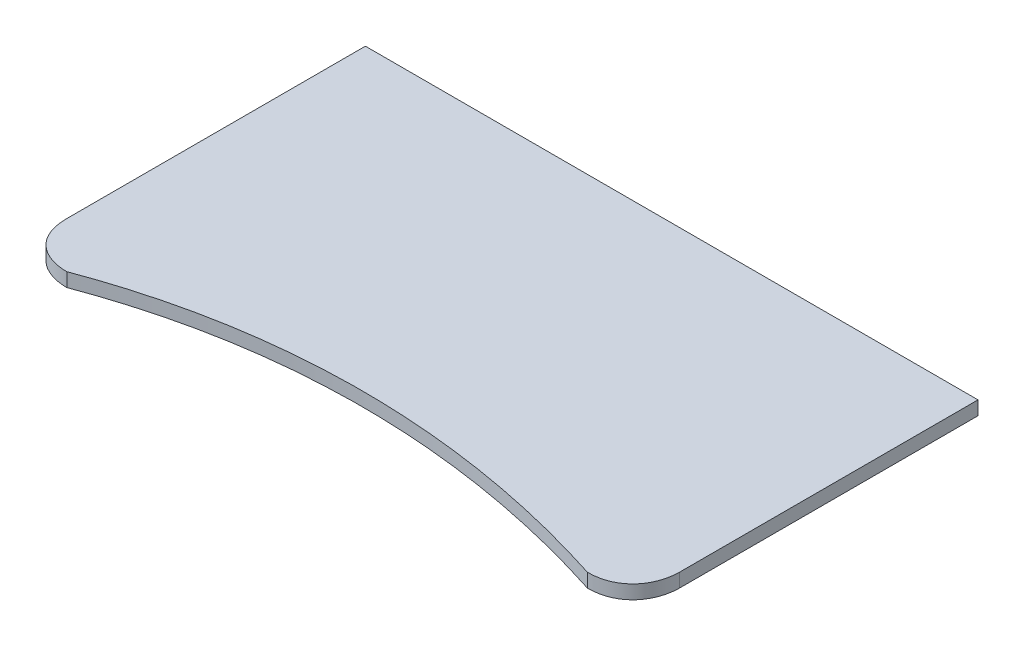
from build123d import *

# Parameters (mm, degrees)
SKETCH1_W           = 800
SKETCH1_H           = 450
BOSS_EXTRUDE1_DEPTH = 18
SKETCH2_W           = 18
SKETCH2_H           = 50
CUT_EXTRUDE1_DEPTH  = 13
CUT_EXTRUDE2_DEPTH  = 18


with BuildPart() as part:
    # Sketch1 → Boss-Extrude1 (new body)
    with BuildSketch(Plane(origin=(0, 0, 0), x_dir=(1, 0, 0), z_dir=(0, 1, 0))):
        Rectangle(SKETCH1_W, SKETCH1_H)
    extrude(amount=BOSS_EXTRUDE1_DEPTH)

    # Sketch2 → Cut-Extrude1 (cut)
    with BuildSketch(Plane(origin=(0, 0, 0), x_dir=(1, 0, 0), z_dir=(0, 1, 0))):
        with Locations((-341, 135)):
            Rectangle(SKETCH2_W, SKETCH2_H)
        with Locations((-341, 25)):
            Rectangle(SKETCH2_W, SKETCH2_H)
        with Locations((-341, -85)):
            Rectangle(SKETCH2_W, SKETCH2_H)
        with Locations((341, -85)):
            Rectangle(SKETCH2_W, SKETCH2_H)
        with Locations((341, 25)):
            Rectangle(SKETCH2_W, SKETCH2_H)
        with Locations((341, 135)):
            Rectangle(SKETCH2_W, SKETCH2_H)
    extrude(amount=CUT_EXTRUDE1_DEPTH, mode=Mode.SUBTRACT)

    # Sketch6 → Cut-Extrude2 (cut)
    with BuildSketch(Plane(origin=(0, 0, 0), x_dir=(-1, 0, 0), z_dir=(0, -1, 0))):
        with BuildLine():
            add(Edge.make_bspline(
                [(-340, -225), (-89.599096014, -144.648306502), (139.782326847, -150.234927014), (340, -225)],
                knots=[0, 0, 0, 0, 1, 1, 1, 1], degree=3))
            Line((-340, -225), (340, -225))
        make_face()
        with BuildLine():
            add(Edge.make_bspline(
                [(-400, -165), (-400, -192.903873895), (-381.788949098, -225), (-340, -225)],
                knots=[0, 0, 0, 0, 1, 1, 1, 1], degree=3))
            Line((-400, -165), (-400, -225))
            Line((-400, -225), (-340, -225))
        make_face()
        with BuildLine():
            add(Edge.make_bspline(
                [(400, -165), (400, -207.944757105), (368.799987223, -225), (340, -225)],
                knots=[0, 0, 0, 0, 1, 1, 1, 1], degree=3))
            Line((340, -225), (400, -225))
            Line((400, -225), (400, -165))
        make_face()
    extrude(amount=-CUT_EXTRUDE2_DEPTH, mode=Mode.SUBTRACT)


solid = part.part
